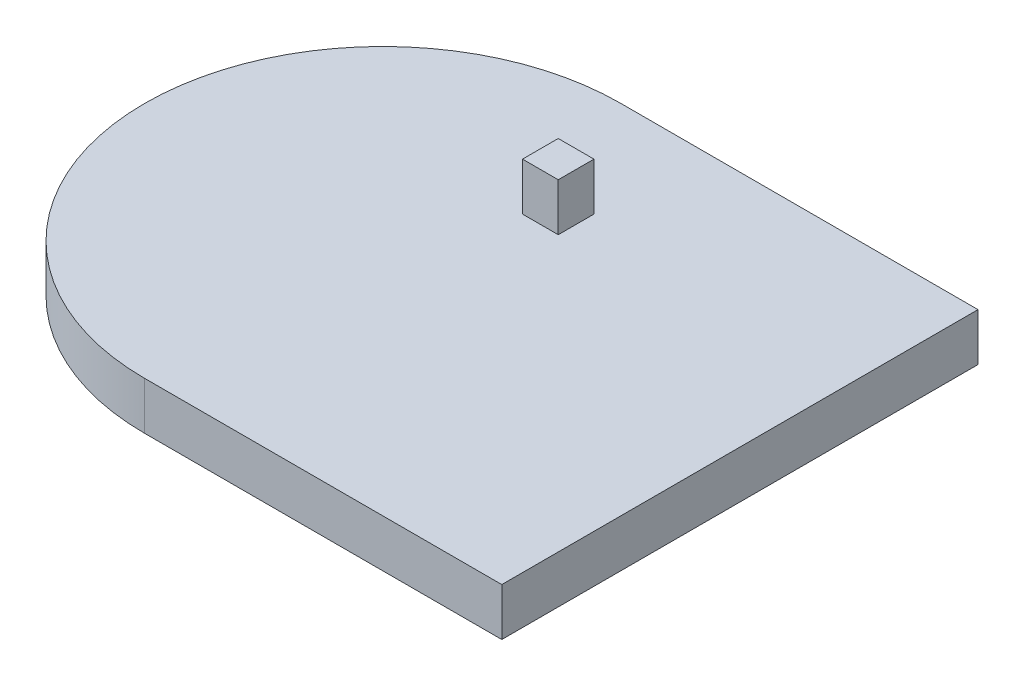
from build123d import *

# Parameters (mm, degrees)
EXTRUDE1_DEPTH = 20
SKETCH3_W      = 15
SKETCH3_H      = 15
EXTRUDE2_DEPTH = 20


with BuildPart() as part:
    # Sketch1 → Extrude1 (new body)
    with BuildSketch(Plane(origin=(0, 0, 0), x_dir=(1, 0, 0), z_dir=(0, 1, 0))):
        with BuildLine():
            Line((-75, 100), (75, 100))
            Line((75, 100), (75, -100))
            Line((75, -100), (-75, -100))
            ThreePointArc((-75, -100), (-175, 0), (-75, 100))
        make_face()
    extrude(amount=EXTRUDE1_DEPTH)

    # Sketch3 → Extrude2 (add)
    with BuildSketch(Plane(origin=(0, 20, 0), x_dir=(-1, 0, 0), z_dir=(0, 1, 0))):
        with Locations((47.88259793, -46.589998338)):
            Rectangle(SKETCH3_W, SKETCH3_H)
    extrude(amount=EXTRUDE2_DEPTH)


solid = part.part
